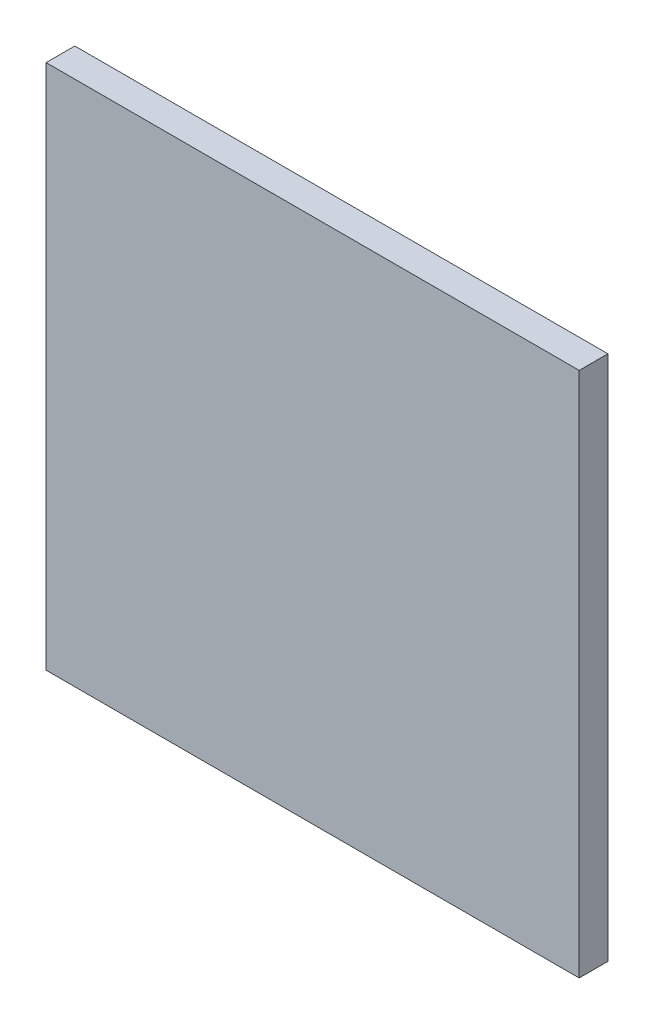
ISO-10303-21;
HEADER;
FILE_DESCRIPTION(('STEP AP214'),'2;1');
FILE_NAME('part.step','',(''),(''),'','','');
FILE_SCHEMA(('AUTOMOTIVE_DESIGN { 1 0 10303 214 1 1 1 1 }'));
ENDSEC;
DATA;
#1=APPLICATION_CONTEXT('core data for automotive mechanical design processes');
#2=APPLICATION_PROTOCOL_DEFINITION('international standard','automotive_design',2000,#1);
#3=PRODUCT_CONTEXT('',#1,'mechanical');
#4=PRODUCT('Part','Part','',(#3));
#5=PRODUCT_RELATED_PRODUCT_CATEGORY('part','',(#4));
#6=PRODUCT_DEFINITION_FORMATION('','',#4);
#7=PRODUCT_DEFINITION_CONTEXT('part definition',#1,'design');
#8=PRODUCT_DEFINITION('design','',#6,#7);
#9=PRODUCT_DEFINITION_SHAPE('','',#8);
#10=(LENGTH_UNIT() NAMED_UNIT(*) SI_UNIT(.MILLI.,.METRE.));
#11=(NAMED_UNIT(*) PLANE_ANGLE_UNIT() SI_UNIT($,.RADIAN.));
#12=(NAMED_UNIT(*) SI_UNIT($,.STERADIAN.) SOLID_ANGLE_UNIT());
#13=UNCERTAINTY_MEASURE_WITH_UNIT(LENGTH_MEASURE(1.E-05),#10,'distance_accuracy_value','');
#14=(GEOMETRIC_REPRESENTATION_CONTEXT(3) GLOBAL_UNCERTAINTY_ASSIGNED_CONTEXT((#13)) GLOBAL_UNIT_ASSIGNED_CONTEXT((#10,
#11,#12)) REPRESENTATION_CONTEXT('',''));
#15=CARTESIAN_POINT('',(0.,0.,0.));
#16=DIRECTION('',(0.,0.,1.));
#17=DIRECTION('',(1.,0.,0.));
#18=AXIS2_PLACEMENT_3D('',#15,#16,#17);
#19=CARTESIAN_POINT('',(0.,0.,1.04));
#20=DIRECTION('',(1.,0.,0.));
#21=DIRECTION('',(0.,1.,0.));
#22=AXIS2_PLACEMENT_3D('',#19,#20,#21);
#23=PLANE('',#22);
#24=DIRECTION('',(0.,-1.,0.));
#25=VECTOR('',#24,1.);
#26=CARTESIAN_POINT('',(0.,0.,0.));
#27=LINE('',#26,#25);
#28=CARTESIAN_POINT('',(0.,19.05,0.));
#29=VERTEX_POINT('',#28);
#30=CARTESIAN_POINT('',(0.,0.,0.));
#31=VERTEX_POINT('',#30);
#32=EDGE_CURVE('E70',#29,#31,#27,.T.);
#33=ORIENTED_EDGE('',*,*,#32,.T.);
#34=DIRECTION('',(0.,0.,-1.));
#35=VECTOR('',#34,1.);
#36=CARTESIAN_POINT('',(0.,0.,1.04));
#37=LINE('',#36,#35);
#38=CARTESIAN_POINT('',(0.,0.,1.04));
#39=VERTEX_POINT('',#38);
#40=EDGE_CURVE('E11',#39,#31,#37,.T.);
#41=ORIENTED_EDGE('',*,*,#40,.F.);
#42=DIRECTION('',(0.,-1.,0.));
#43=VECTOR('',#42,1.);
#44=CARTESIAN_POINT('',(0.,0.,1.04));
#45=LINE('',#44,#43);
#46=CARTESIAN_POINT('',(0.,19.05,1.04));
#47=VERTEX_POINT('',#46);
#48=EDGE_CURVE('E88',#47,#39,#45,.T.);
#49=ORIENTED_EDGE('',*,*,#48,.F.);
#50=DIRECTION('',(0.,0.,-1.));
#51=VECTOR('',#50,1.);
#52=CARTESIAN_POINT('',(0.,19.05,1.04));
#53=LINE('',#52,#51);
#54=EDGE_CURVE('E82',#47,#29,#53,.T.);
#55=ORIENTED_EDGE('',*,*,#54,.T.);
#56=EDGE_LOOP('',(#33,#41,#49,#55));
#57=FACE_BOUND('',#56,.T.);
#58=ADVANCED_FACE('F26',(#57),#23,.F.);
#59=CARTESIAN_POINT('',(0.,0.,1.04));
#60=DIRECTION('',(0.,1.,0.));
#61=DIRECTION('',(0.,0.,1.));
#62=AXIS2_PLACEMENT_3D('',#59,#60,#61);
#63=PLANE('',#62);
#64=DIRECTION('',(1.,0.,0.));
#65=VECTOR('',#64,1.);
#66=CARTESIAN_POINT('',(0.,0.,0.));
#67=LINE('',#66,#65);
#68=CARTESIAN_POINT('',(19.3,0.,0.));
#69=VERTEX_POINT('',#68);
#70=EDGE_CURVE('E66',#31,#69,#67,.T.);
#71=ORIENTED_EDGE('',*,*,#70,.T.);
#72=DIRECTION('',(0.,0.,-1.));
#73=VECTOR('',#72,1.);
#74=CARTESIAN_POINT('',(19.3,0.,1.04));
#75=LINE('',#74,#73);
#76=CARTESIAN_POINT('',(19.3,0.,1.04));
#77=VERTEX_POINT('',#76);
#78=EDGE_CURVE('E33',#77,#69,#75,.T.);
#79=ORIENTED_EDGE('',*,*,#78,.F.);
#80=DIRECTION('',(1.,0.,0.));
#81=VECTOR('',#80,1.);
#82=CARTESIAN_POINT('',(0.,0.,1.04));
#83=LINE('',#82,#81);
#84=EDGE_CURVE('E78',#39,#77,#83,.T.);
#85=ORIENTED_EDGE('',*,*,#84,.F.);
#86=ORIENTED_EDGE('',*,*,#40,.T.);
#87=EDGE_LOOP('',(#71,#79,#85,#86));
#88=FACE_BOUND('',#87,.T.);
#89=ADVANCED_FACE('F77',(#88),#63,.F.);
#90=CARTESIAN_POINT('',(19.3,0.,1.04));
#91=DIRECTION('',(-1.,0.,0.));
#92=DIRECTION('',(0.,-1.,0.));
#93=AXIS2_PLACEMENT_3D('',#90,#91,#92);
#94=PLANE('',#93);
#95=DIRECTION('',(0.,1.,0.));
#96=VECTOR('',#95,1.);
#97=CARTESIAN_POINT('',(19.3,0.,0.));
#98=LINE('',#97,#96);
#99=CARTESIAN_POINT('',(19.3,19.05,0.));
#100=VERTEX_POINT('',#99);
#101=EDGE_CURVE('E71',#69,#100,#98,.T.);
#102=ORIENTED_EDGE('',*,*,#101,.T.);
#103=DIRECTION('',(0.,0.,-1.));
#104=VECTOR('',#103,1.);
#105=CARTESIAN_POINT('',(19.3,19.05,1.04));
#106=LINE('',#105,#104);
#107=CARTESIAN_POINT('',(19.3,19.05,1.04));
#108=VERTEX_POINT('',#107);
#109=EDGE_CURVE('E94',#108,#100,#106,.T.);
#110=ORIENTED_EDGE('',*,*,#109,.F.);
#111=DIRECTION('',(0.,1.,0.));
#112=VECTOR('',#111,1.);
#113=CARTESIAN_POINT('',(19.3,0.,1.04));
#114=LINE('',#113,#112);
#115=EDGE_CURVE('E45',#77,#108,#114,.T.);
#116=ORIENTED_EDGE('',*,*,#115,.F.);
#117=ORIENTED_EDGE('',*,*,#78,.T.);
#118=EDGE_LOOP('',(#102,#110,#116,#117));
#119=FACE_BOUND('',#118,.T.);
#120=ADVANCED_FACE('F97',(#119),#94,.F.);
#121=CARTESIAN_POINT('',(0.,19.05,1.04));
#122=DIRECTION('',(0.,-1.,0.));
#123=DIRECTION('',(0.,0.,-1.));
#124=AXIS2_PLACEMENT_3D('',#121,#122,#123);
#125=PLANE('',#124);
#126=DIRECTION('',(-1.,0.,0.));
#127=VECTOR('',#126,1.);
#128=CARTESIAN_POINT('',(0.,19.05,0.));
#129=LINE('',#128,#127);
#130=EDGE_CURVE('E86',#100,#29,#129,.T.);
#131=ORIENTED_EDGE('',*,*,#130,.T.);
#132=ORIENTED_EDGE('',*,*,#54,.F.);
#133=DIRECTION('',(-1.,0.,0.));
#134=VECTOR('',#133,1.);
#135=CARTESIAN_POINT('',(0.,19.05,1.04));
#136=LINE('',#135,#134);
#137=EDGE_CURVE('E40',#108,#47,#136,.T.);
#138=ORIENTED_EDGE('',*,*,#137,.F.);
#139=ORIENTED_EDGE('',*,*,#109,.T.);
#140=EDGE_LOOP('',(#131,#132,#138,#139));
#141=FACE_BOUND('',#140,.T.);
#142=ADVANCED_FACE('F99',(#141),#125,.F.);
#143=CARTESIAN_POINT('',(0.,19.05,1.04));
#144=DIRECTION('',(0.,0.,-1.));
#145=DIRECTION('',(-1.,0.,0.));
#146=AXIS2_PLACEMENT_3D('',#143,#144,#145);
#147=PLANE('',#146);
#148=ORIENTED_EDGE('',*,*,#48,.T.);
#149=ORIENTED_EDGE('',*,*,#84,.T.);
#150=ORIENTED_EDGE('',*,*,#115,.T.);
#151=ORIENTED_EDGE('',*,*,#137,.T.);
#152=EDGE_LOOP('',(#148,#149,#150,#151));
#153=FACE_BOUND('',#152,.T.);
#154=ADVANCED_FACE('F100',(#153),#147,.F.);
#155=CARTESIAN_POINT('',(0.,19.05,0.));
#156=DIRECTION('',(0.,0.,-1.));
#157=DIRECTION('',(-1.,0.,0.));
#158=AXIS2_PLACEMENT_3D('',#155,#156,#157);
#159=PLANE('',#158);
#160=ORIENTED_EDGE('',*,*,#32,.F.);
#161=ORIENTED_EDGE('',*,*,#130,.F.);
#162=ORIENTED_EDGE('',*,*,#101,.F.);
#163=ORIENTED_EDGE('',*,*,#70,.F.);
#164=EDGE_LOOP('',(#160,#161,#162,#163));
#165=FACE_BOUND('',#164,.T.);
#166=ADVANCED_FACE('F67',(#165),#159,.T.);
#167=CLOSED_SHELL('',(#58,#89,#120,#142,#154,#166));
#168=MANIFOLD_SOLID_BREP('B2',#167);
#169=ADVANCED_BREP_SHAPE_REPRESENTATION('',(#18,#168),#14);
#170=SHAPE_DEFINITION_REPRESENTATION(#9,#169);
ENDSEC;
END-ISO-10303-21;
